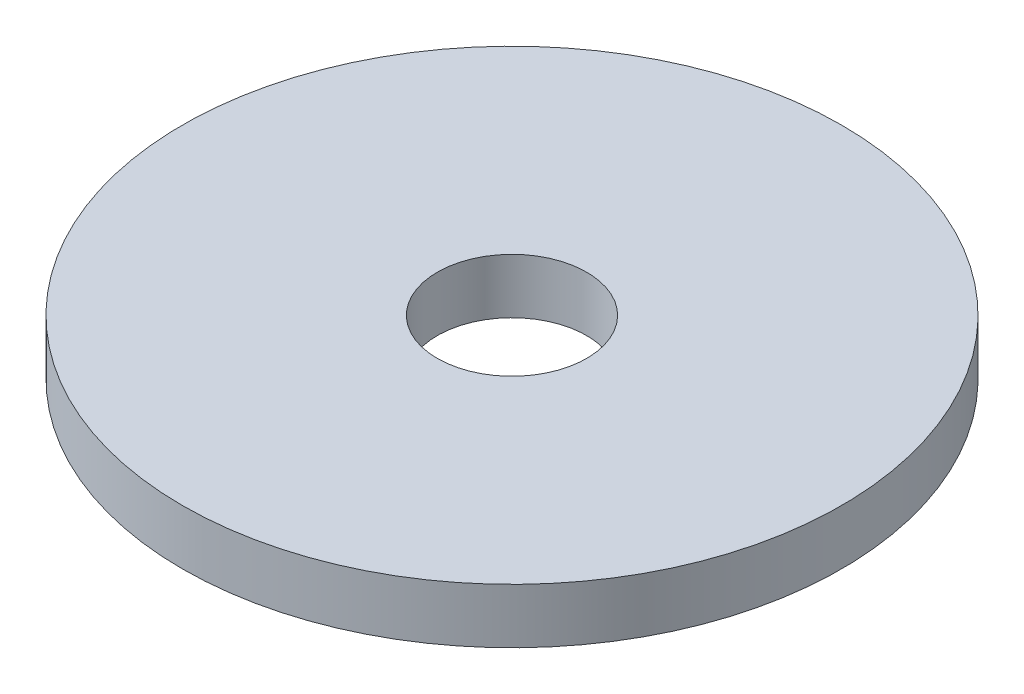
from build123d import *

# Parameters (mm, degrees)
ESQUISSE1_R      = 15
ESQUISSE1_R_2    = 3.4
EXTRUSION1_DEPTH = 2.5


with BuildPart() as part:
    # Esquisse1 → Extrusion1 (new body)
    with BuildSketch(Plane(origin=(0, 0, 0), x_dir=(1, 0, 0), z_dir=(0, 1, 0))):
        with Locations(Location((0, 0, 0), (0, 0, 270))):
            Circle(ESQUISSE1_R)
        with Locations(Location((0, 0, 0), (0, 0, 270))):
            Circle(ESQUISSE1_R_2, mode=Mode.SUBTRACT)
    extrude(amount=EXTRUSION1_DEPTH)


solid = part.part
